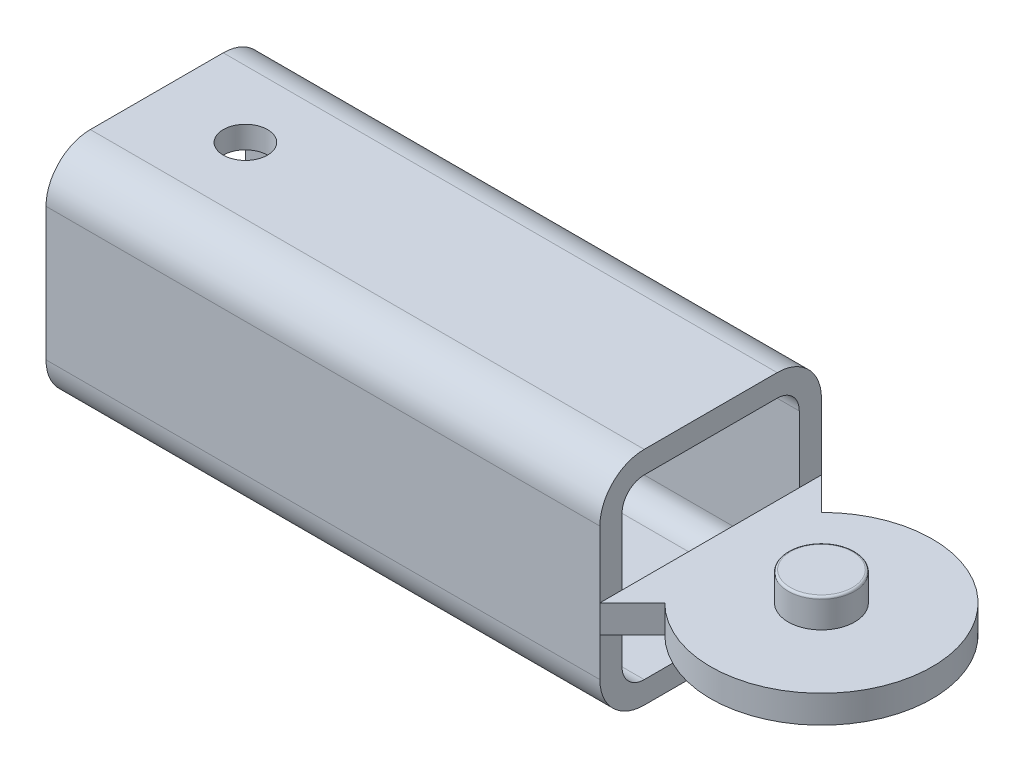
ISO-10303-21;
HEADER;
FILE_DESCRIPTION(('STEP AP214'),'2;1');
FILE_NAME('part.step','',(''),(''),'','','');
FILE_SCHEMA(('AUTOMOTIVE_DESIGN { 1 0 10303 214 1 1 1 1 }'));
ENDSEC;
DATA;
#1=APPLICATION_CONTEXT('core data for automotive mechanical design processes');
#2=APPLICATION_PROTOCOL_DEFINITION('international standard','automotive_design',2000,#1);
#3=PRODUCT_CONTEXT('',#1,'mechanical');
#4=PRODUCT('Part','Part','',(#3));
#5=PRODUCT_RELATED_PRODUCT_CATEGORY('part','',(#4));
#6=PRODUCT_DEFINITION_FORMATION('','',#4);
#7=PRODUCT_DEFINITION_CONTEXT('part definition',#1,'design');
#8=PRODUCT_DEFINITION('design','',#6,#7);
#9=PRODUCT_DEFINITION_SHAPE('','',#8);
#10=(LENGTH_UNIT() NAMED_UNIT(*) SI_UNIT(.MILLI.,.METRE.));
#11=(NAMED_UNIT(*) PLANE_ANGLE_UNIT() SI_UNIT($,.RADIAN.));
#12=(NAMED_UNIT(*) SI_UNIT($,.STERADIAN.) SOLID_ANGLE_UNIT());
#13=UNCERTAINTY_MEASURE_WITH_UNIT(LENGTH_MEASURE(1.E-05),#10,'distance_accuracy_value','');
#14=(GEOMETRIC_REPRESENTATION_CONTEXT(3) GLOBAL_UNCERTAINTY_ASSIGNED_CONTEXT((#13)) GLOBAL_UNIT_ASSIGNED_CONTEXT((#10,
#11,#12)) REPRESENTATION_CONTEXT('',''));
#15=CARTESIAN_POINT('',(0.,0.,0.));
#16=DIRECTION('',(0.,0.,1.));
#17=DIRECTION('',(1.,0.,0.));
#18=AXIS2_PLACEMENT_3D('',#15,#16,#17);
#19=CARTESIAN_POINT('',(32.6756198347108,2.6,0.));
#20=DIRECTION('',(0.,-1.,0.));
#21=DIRECTION('',(0.,0.,-1.));
#22=AXIS2_PLACEMENT_3D('',#19,#20,#21);
#23=CYLINDRICAL_SURFACE('',#22,3.);
#24=CARTESIAN_POINT('',(32.6756198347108,2.4,0.));
#25=DIRECTION('',(0.,1.,0.));
#26=DIRECTION('',(0.,0.,1.));
#27=AXIS2_PLACEMENT_3D('',#24,#25,#26);
#28=CIRCLE('',#27,3.);
#29=CARTESIAN_POINT('',(32.6756198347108,2.4,3.));
#30=VERTEX_POINT('',#29);
#31=EDGE_CURVE('E12',#30,#30,#28,.F.);
#32=ORIENTED_EDGE('',*,*,#31,.T.);
#33=EDGE_LOOP('',(#32));
#34=FACE_BOUND('',#33,.T.);
#35=CARTESIAN_POINT('',(32.6756198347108,0.,0.));
#36=DIRECTION('',(0.,1.,0.));
#37=DIRECTION('',(0.,0.,1.));
#38=AXIS2_PLACEMENT_3D('',#35,#36,#37);
#39=CIRCLE('',#38,3.);
#40=CARTESIAN_POINT('',(32.6756198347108,0.,3.));
#41=VERTEX_POINT('',#40);
#42=EDGE_CURVE('E92',#41,#41,#39,.T.);
#43=ORIENTED_EDGE('',*,*,#42,.T.);
#44=EDGE_LOOP('',(#43));
#45=FACE_BOUND('',#44,.T.);
#46=ADVANCED_FACE('F81',(#34,#45),#23,.T.);
#47=CARTESIAN_POINT('',(32.6756198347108,2.6,0.));
#48=DIRECTION('',(0.,1.,0.));
#49=DIRECTION('',(0.,0.,1.));
#50=AXIS2_PLACEMENT_3D('',#47,#48,#49);
#51=PLANE('',#50);
#52=CARTESIAN_POINT('',(32.6756198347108,2.6,0.));
#53=DIRECTION('',(0.,1.,0.));
#54=DIRECTION('',(0.,0.,1.));
#55=AXIS2_PLACEMENT_3D('',#52,#53,#54);
#56=CIRCLE('',#55,2.8);
#57=CARTESIAN_POINT('',(32.6756198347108,2.6,2.8));
#58=VERTEX_POINT('',#57);
#59=EDGE_CURVE('E88',#58,#58,#56,.T.);
#60=ORIENTED_EDGE('',*,*,#59,.T.);
#61=EDGE_LOOP('',(#60));
#62=FACE_BOUND('',#61,.T.);
#63=ADVANCED_FACE('F102',(#62),#51,.T.);
#64=CARTESIAN_POINT('',(32.6756198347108,0.,0.));
#65=DIRECTION('',(0.,1.,0.));
#66=DIRECTION('',(0.,0.,1.));
#67=AXIS2_PLACEMENT_3D('',#64,#65,#66);
#68=PLANE('',#67);
#69=ORIENTED_EDGE('',*,*,#42,.F.);
#70=EDGE_LOOP('',(#69));
#71=FACE_BOUND('',#70,.T.);
#72=ADVANCED_FACE('F100',(#71),#68,.F.);
#73=CARTESIAN_POINT('',(32.6756198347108,2.4,0.));
#74=DIRECTION('',(0.,1.,0.));
#75=DIRECTION('',(0.,0.,1.));
#76=AXIS2_PLACEMENT_3D('',#73,#74,#75);
#77=TOROIDAL_SURFACE('',#76,2.8,0.2);
#78=ORIENTED_EDGE('',*,*,#31,.F.);
#79=EDGE_LOOP('',(#78));
#80=FACE_BOUND('',#79,.T.);
#81=ORIENTED_EDGE('',*,*,#59,.F.);
#82=EDGE_LOOP('',(#81));
#83=FACE_BOUND('',#82,.T.);
#84=ADVANCED_FACE('F83',(#80,#83),#77,.T.);
#85=CLOSED_SHELL('',(#46,#63,#72,#84));
#86=MANIFOLD_SOLID_BREP('B2',#85);
#87=CARTESIAN_POINT('',(22.6756198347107,-6.,10.));
#88=DIRECTION('',(0.,0.,-1.));
#89=DIRECTION('',(-1.,0.,0.));
#90=AXIS2_PLACEMENT_3D('',#87,#88,#89);
#91=PLANE('',#90);
#92=DIRECTION('',(0.,-1.,0.));
#93=VECTOR('',#92,1.);
#94=CARTESIAN_POINT('',(22.6756198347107,-6.,10.));
#95=LINE('',#94,#93);
#96=CARTESIAN_POINT('',(22.6756198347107,-2.5,10.));
#97=VERTEX_POINT('',#96);
#98=CARTESIAN_POINT('',(22.6756198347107,-6.,10.));
#99=VERTEX_POINT('',#98);
#100=EDGE_CURVE('E396',#97,#99,#95,.T.);
#101=ORIENTED_EDGE('',*,*,#100,.F.);
#102=DIRECTION('',(0.,1.,0.));
#103=VECTOR('',#102,1.);
#104=CARTESIAN_POINT('',(22.6756198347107,-20.,10.));
#105=LINE('',#104,#103);
#106=CARTESIAN_POINT('',(22.6756198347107,0.,10.));
#107=VERTEX_POINT('',#106);
#108=EDGE_CURVE('E314',#97,#107,#105,.T.);
#109=ORIENTED_EDGE('',*,*,#108,.T.);
#110=CARTESIAN_POINT('',(22.6756198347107,6.,10.));
#111=VERTEX_POINT('',#110);
#112=EDGE_CURVE('E397',#111,#107,#95,.T.);
#113=ORIENTED_EDGE('',*,*,#112,.F.);
#114=DIRECTION('',(-1.,0.,0.));
#115=VECTOR('',#114,1.);
#116=CARTESIAN_POINT('',(22.6756198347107,6.,10.));
#117=LINE('',#116,#115);
#118=CARTESIAN_POINT('',(-27.3243801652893,6.,10.));
#119=VERTEX_POINT('',#118);
#120=EDGE_CURVE('E491',#111,#119,#117,.T.);
#121=ORIENTED_EDGE('',*,*,#120,.T.);
#122=DIRECTION('',(0.,-1.,0.));
#123=VECTOR('',#122,1.);
#124=CARTESIAN_POINT('',(-27.3243801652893,-6.,10.));
#125=LINE('',#124,#123);
#126=CARTESIAN_POINT('',(-27.3243801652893,-6.,10.));
#127=VERTEX_POINT('',#126);
#128=EDGE_CURVE('E456',#119,#127,#125,.T.);
#129=ORIENTED_EDGE('',*,*,#128,.T.);
#130=DIRECTION('',(-1.,0.,0.));
#131=VECTOR('',#130,1.);
#132=CARTESIAN_POINT('',(22.6756198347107,-6.,10.));
#133=LINE('',#132,#131);
#134=EDGE_CURVE('E487',#99,#127,#133,.T.);
#135=ORIENTED_EDGE('',*,*,#134,.F.);
#136=EDGE_LOOP('',(#101,#109,#113,#121,#129,#135));
#137=FACE_BOUND('',#136,.T.);
#138=ADVANCED_FACE('F137',(#137),#91,.F.);
#139=CARTESIAN_POINT('',(42.6756198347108,0.,10.));
#140=DIRECTION('',(0.,-1.,0.));
#141=DIRECTION('',(0.,0.,-1.));
#142=AXIS2_PLACEMENT_3D('',#139,#140,#141);
#143=PLANE('',#142);
#144=DIRECTION('',(-0.707106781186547,0.,0.707106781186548));
#145=VECTOR('',#144,1.);
#146=CARTESIAN_POINT('',(25.6045520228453,0.,7.07106781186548));
#147=LINE('',#146,#145);
#148=CARTESIAN_POINT('',(25.6045520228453,0.,7.07106781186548));
#149=VERTEX_POINT('',#148);
#150=EDGE_CURVE('E310',#149,#107,#147,.T.);
#151=ORIENTED_EDGE('',*,*,#150,.F.);
#152=CARTESIAN_POINT('',(32.6756198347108,0.,0.));
#153=DIRECTION('',(0.,-1.,0.));
#154=DIRECTION('',(0.,0.,-1.));
#155=AXIS2_PLACEMENT_3D('',#152,#153,#154);
#156=CIRCLE('',#155,10.);
#157=CARTESIAN_POINT('',(25.6045520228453,0.,-7.07106781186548));
#158=VERTEX_POINT('',#157);
#159=EDGE_CURVE('E293',#158,#149,#156,.T.);
#160=ORIENTED_EDGE('',*,*,#159,.F.);
#161=DIRECTION('',(0.707106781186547,0.,0.707106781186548));
#162=VECTOR('',#161,1.);
#163=CARTESIAN_POINT('',(25.6045520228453,0.,-7.07106781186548));
#164=LINE('',#163,#162);
#165=CARTESIAN_POINT('',(22.6756198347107,0.,-10.));
#166=VERTEX_POINT('',#165);
#167=EDGE_CURVE('E319',#166,#158,#164,.T.);
#168=ORIENTED_EDGE('',*,*,#167,.F.);
#169=DIRECTION('',(0.,0.,1.));
#170=VECTOR('',#169,1.);
#171=CARTESIAN_POINT('',(22.6756198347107,0.,10.));
#172=LINE('',#171,#170);
#173=CARTESIAN_POINT('',(22.6756198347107,0.,-8.));
#174=VERTEX_POINT('',#173);
#175=EDGE_CURVE('E344',#166,#174,#172,.T.);
#176=ORIENTED_EDGE('',*,*,#175,.T.);
#177=CARTESIAN_POINT('',(22.6756198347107,0.,8.));
#178=VERTEX_POINT('',#177);
#179=EDGE_CURVE('E343',#174,#178,#172,.T.);
#180=ORIENTED_EDGE('',*,*,#179,.T.);
#181=EDGE_CURVE('E147',#178,#107,#172,.T.);
#182=ORIENTED_EDGE('',*,*,#181,.T.);
#183=EDGE_LOOP('',(#151,#160,#168,#176,#180,#182));
#184=FACE_BOUND('',#183,.T.);
#185=ADVANCED_FACE('F316',(#184),#143,.F.);
#186=CARTESIAN_POINT('',(42.6756198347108,-2.5,10.));
#187=DIRECTION('',(0.,1.,0.));
#188=DIRECTION('',(0.,0.,1.));
#189=AXIS2_PLACEMENT_3D('',#186,#187,#188);
#190=PLANE('',#189);
#191=CARTESIAN_POINT('',(32.6756198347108,-2.5,0.));
#192=DIRECTION('',(0.,-1.,0.));
#193=DIRECTION('',(0.,0.,-1.));
#194=AXIS2_PLACEMENT_3D('',#191,#192,#193);
#195=CIRCLE('',#194,8.);
#196=CARTESIAN_POINT('',(32.6756198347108,-2.5,-8.));
#197=VERTEX_POINT('',#196);
#198=EDGE_CURVE('E326',#197,#197,#195,.T.);
#199=ORIENTED_EDGE('',*,*,#198,.F.);
#200=EDGE_LOOP('',(#199));
#201=FACE_BOUND('',#200,.T.);
#202=CARTESIAN_POINT('',(32.6756198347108,-2.5,0.));
#203=DIRECTION('',(0.,1.,0.));
#204=DIRECTION('',(0.,0.,1.));
#205=AXIS2_PLACEMENT_3D('',#202,#203,#204);
#206=CIRCLE('',#205,10.);
#207=CARTESIAN_POINT('',(25.6045520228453,-2.5,-7.07106781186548));
#208=VERTEX_POINT('',#207);
#209=CARTESIAN_POINT('',(25.6045520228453,-2.5,7.07106781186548));
#210=VERTEX_POINT('',#209);
#211=EDGE_CURVE('E304',#208,#210,#206,.F.);
#212=ORIENTED_EDGE('',*,*,#211,.T.);
#213=DIRECTION('',(-0.707106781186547,0.,0.707106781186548));
#214=VECTOR('',#213,1.);
#215=CARTESIAN_POINT('',(32.6756198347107,-2.5,0.));
#216=LINE('',#215,#214);
#217=EDGE_CURVE('E305',#210,#97,#216,.T.);
#218=ORIENTED_EDGE('',*,*,#217,.T.);
#219=DIRECTION('',(0.,0.,-1.));
#220=VECTOR('',#219,1.);
#221=CARTESIAN_POINT('',(22.6756198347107,-2.5,10.));
#222=LINE('',#221,#220);
#223=CARTESIAN_POINT('',(22.6756198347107,-2.5,8.));
#224=VERTEX_POINT('',#223);
#225=EDGE_CURVE('E149',#97,#224,#222,.T.);
#226=ORIENTED_EDGE('',*,*,#225,.T.);
#227=CARTESIAN_POINT('',(22.6756198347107,-2.5,-8.));
#228=VERTEX_POINT('',#227);
#229=EDGE_CURVE('E150',#224,#228,#222,.T.);
#230=ORIENTED_EDGE('',*,*,#229,.T.);
#231=CARTESIAN_POINT('',(22.6756198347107,-2.5,-10.));
#232=VERTEX_POINT('',#231);
#233=EDGE_CURVE('E79',#228,#232,#222,.T.);
#234=ORIENTED_EDGE('',*,*,#233,.T.);
#235=DIRECTION('',(0.707106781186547,0.,0.707106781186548));
#236=VECTOR('',#235,1.);
#237=CARTESIAN_POINT('',(42.6756198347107,-2.5,10.));
#238=LINE('',#237,#236);
#239=EDGE_CURVE('E329',#232,#208,#238,.T.);
#240=ORIENTED_EDGE('',*,*,#239,.T.);
#241=EDGE_LOOP('',(#212,#218,#226,#230,#234,#240));
#242=FACE_BOUND('',#241,.T.);
#243=ADVANCED_FACE('F586',(#201,#242),#190,.F.);
#244=CARTESIAN_POINT('',(22.6756198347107,6.,-6.));
#245=DIRECTION('',(1.,0.,0.));
#246=DIRECTION('',(0.,0.,-1.));
#247=AXIS2_PLACEMENT_3D('',#244,#245,#246);
#248=PLANE('',#247);
#249=ORIENTED_EDGE('',*,*,#225,.F.);
#250=ORIENTED_EDGE('',*,*,#100,.T.);
#251=CARTESIAN_POINT('',(22.6756198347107,-6.,6.));
#252=DIRECTION('',(1.,0.,0.));
#253=DIRECTION('',(0.,0.,-1.));
#254=AXIS2_PLACEMENT_3D('',#251,#252,#253);
#255=CIRCLE('',#254,4.);
#256=CARTESIAN_POINT('',(22.6756198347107,-10.,6.));
#257=VERTEX_POINT('',#256);
#258=EDGE_CURVE('E400',#99,#257,#255,.T.);
#259=ORIENTED_EDGE('',*,*,#258,.T.);
#260=DIRECTION('',(0.,0.,-1.));
#261=VECTOR('',#260,1.);
#262=CARTESIAN_POINT('',(22.6756198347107,-10.,6.));
#263=LINE('',#262,#261);
#264=CARTESIAN_POINT('',(22.6756198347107,-10.,-6.));
#265=VERTEX_POINT('',#264);
#266=EDGE_CURVE('E403',#257,#265,#263,.T.);
#267=ORIENTED_EDGE('',*,*,#266,.T.);
#268=CARTESIAN_POINT('',(22.6756198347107,-6.,-6.));
#269=DIRECTION('',(1.,0.,0.));
#270=DIRECTION('',(0.,0.,-1.));
#271=AXIS2_PLACEMENT_3D('',#268,#269,#270);
#272=CIRCLE('',#271,4.);
#273=CARTESIAN_POINT('',(22.6756198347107,-6.,-10.));
#274=VERTEX_POINT('',#273);
#275=EDGE_CURVE('E406',#265,#274,#272,.T.);
#276=ORIENTED_EDGE('',*,*,#275,.T.);
#277=DIRECTION('',(0.,1.,0.));
#278=VECTOR('',#277,1.);
#279=CARTESIAN_POINT('',(22.6756198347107,6.,-10.));
#280=LINE('',#279,#278);
#281=EDGE_CURVE('E410',#274,#232,#280,.T.);
#282=ORIENTED_EDGE('',*,*,#281,.T.);
#283=ORIENTED_EDGE('',*,*,#233,.F.);
#284=DIRECTION('',(0.,1.,0.));
#285=VECTOR('',#284,1.);
#286=CARTESIAN_POINT('',(22.6756198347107,6.,-8.));
#287=LINE('',#286,#285);
#288=CARTESIAN_POINT('',(22.6756198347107,-6.,-8.));
#289=VERTEX_POINT('',#288);
#290=EDGE_CURVE('E365',#289,#228,#287,.T.);
#291=ORIENTED_EDGE('',*,*,#290,.F.);
#292=CARTESIAN_POINT('',(22.6756198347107,-6.,-6.));
#293=DIRECTION('',(1.,0.,0.));
#294=DIRECTION('',(0.,0.,-1.));
#295=AXIS2_PLACEMENT_3D('',#292,#293,#294);
#296=CIRCLE('',#295,2.);
#297=CARTESIAN_POINT('',(22.6756198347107,-8.,-6.));
#298=VERTEX_POINT('',#297);
#299=EDGE_CURVE('E369',#298,#289,#296,.T.);
#300=ORIENTED_EDGE('',*,*,#299,.F.);
#301=DIRECTION('',(0.,0.,-1.));
#302=VECTOR('',#301,1.);
#303=CARTESIAN_POINT('',(22.6756198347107,-8.,6.));
#304=LINE('',#303,#302);
#305=CARTESIAN_POINT('',(22.6756198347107,-8.,6.));
#306=VERTEX_POINT('',#305);
#307=EDGE_CURVE('E374',#306,#298,#304,.T.);
#308=ORIENTED_EDGE('',*,*,#307,.F.);
#309=CARTESIAN_POINT('',(22.6756198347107,-6.,6.));
#310=DIRECTION('',(1.,0.,0.));
#311=DIRECTION('',(0.,0.,-1.));
#312=AXIS2_PLACEMENT_3D('',#309,#310,#311);
#313=CIRCLE('',#312,2.);
#314=CARTESIAN_POINT('',(22.6756198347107,-6.,8.));
#315=VERTEX_POINT('',#314);
#316=EDGE_CURVE('E378',#315,#306,#313,.T.);
#317=ORIENTED_EDGE('',*,*,#316,.F.);
#318=DIRECTION('',(0.,-1.,0.));
#319=VECTOR('',#318,1.);
#320=CARTESIAN_POINT('',(22.6756198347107,-6.,8.));
#321=LINE('',#320,#319);
#322=EDGE_CURVE('E157',#224,#315,#321,.T.);
#323=ORIENTED_EDGE('',*,*,#322,.F.);
#324=EDGE_LOOP('',(#249,#250,#259,#267,#276,#282,#283,#291,#300,#308,#317,#323));
#325=FACE_BOUND('',#324,.T.);
#326=ADVANCED_FACE('F587',(#325),#248,.T.);
#327=CARTESIAN_POINT('',(22.6756198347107,6.,-6.));
#328=DIRECTION('',(-1.,0.,0.));
#329=DIRECTION('',(0.,0.,1.));
#330=AXIS2_PLACEMENT_3D('',#327,#328,#329);
#331=CYLINDRICAL_SURFACE('',#330,4.);
#332=CARTESIAN_POINT('',(-27.3243801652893,6.,-6.));
#333=DIRECTION('',(1.,0.,0.));
#334=DIRECTION('',(0.,0.,-1.));
#335=AXIS2_PLACEMENT_3D('',#332,#333,#334);
#336=CIRCLE('',#335,4.);
#337=CARTESIAN_POINT('',(-27.3243801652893,6.,-10.));
#338=VERTEX_POINT('',#337);
#339=CARTESIAN_POINT('',(-27.3243801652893,10.,-6.));
#340=VERTEX_POINT('',#339);
#341=EDGE_CURVE('E446',#338,#340,#336,.T.);
#342=ORIENTED_EDGE('',*,*,#341,.T.);
#343=DIRECTION('',(-1.,0.,0.));
#344=VECTOR('',#343,1.);
#345=CARTESIAN_POINT('',(22.6756198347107,10.,-6.));
#346=LINE('',#345,#344);
#347=CARTESIAN_POINT('',(22.6756198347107,10.,-6.));
#348=VERTEX_POINT('',#347);
#349=EDGE_CURVE('E499',#348,#340,#346,.T.);
#350=ORIENTED_EDGE('',*,*,#349,.F.);
#351=CARTESIAN_POINT('',(22.6756198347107,6.,-6.));
#352=DIRECTION('',(1.,0.,0.));
#353=DIRECTION('',(0.,0.,-1.));
#354=AXIS2_PLACEMENT_3D('',#351,#352,#353);
#355=CIRCLE('',#354,4.);
#356=CARTESIAN_POINT('',(22.6756198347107,6.,-10.));
#357=VERTEX_POINT('',#356);
#358=EDGE_CURVE('E385',#357,#348,#355,.T.);
#359=ORIENTED_EDGE('',*,*,#358,.F.);
#360=DIRECTION('',(-1.,0.,0.));
#361=VECTOR('',#360,1.);
#362=CARTESIAN_POINT('',(22.6756198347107,6.,-10.));
#363=LINE('',#362,#361);
#364=EDGE_CURVE('E470',#357,#338,#363,.T.);
#365=ORIENTED_EDGE('',*,*,#364,.T.);
#366=EDGE_LOOP('',(#342,#350,#359,#365));
#367=FACE_BOUND('',#366,.T.);
#368=ADVANCED_FACE('F571',(#367),#331,.T.);
#369=CARTESIAN_POINT('',(22.6756198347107,10.,-6.));
#370=DIRECTION('',(0.,-1.,0.));
#371=DIRECTION('',(0.,0.,-1.));
#372=AXIS2_PLACEMENT_3D('',#369,#370,#371);
#373=PLANE('',#372);
#374=CARTESIAN_POINT('',(-19.3243801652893,10.,0.));
#375=DIRECTION('',(0.,-1.,0.));
#376=DIRECTION('',(0.,0.,-1.));
#377=AXIS2_PLACEMENT_3D('',#374,#375,#376);
#378=CIRCLE('',#377,2.);
#379=CARTESIAN_POINT('',(-19.3243801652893,10.,-2.));
#380=VERTEX_POINT('',#379);
#381=EDGE_CURVE('E680',#380,#380,#378,.T.);
#382=ORIENTED_EDGE('',*,*,#381,.T.);
#383=EDGE_LOOP('',(#382));
#384=FACE_BOUND('',#383,.T.);
#385=DIRECTION('',(0.,0.,1.));
#386=VECTOR('',#385,1.);
#387=CARTESIAN_POINT('',(-27.3243801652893,10.,-6.));
#388=LINE('',#387,#386);
#389=CARTESIAN_POINT('',(-27.3243801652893,10.,6.));
#390=VERTEX_POINT('',#389);
#391=EDGE_CURVE('E450',#340,#390,#388,.T.);
#392=ORIENTED_EDGE('',*,*,#391,.T.);
#393=DIRECTION('',(-1.,0.,0.));
#394=VECTOR('',#393,1.);
#395=CARTESIAN_POINT('',(22.6756198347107,10.,6.));
#396=LINE('',#395,#394);
#397=CARTESIAN_POINT('',(22.6756198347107,10.,6.));
#398=VERTEX_POINT('',#397);
#399=EDGE_CURVE('E495',#398,#390,#396,.T.);
#400=ORIENTED_EDGE('',*,*,#399,.F.);
#401=DIRECTION('',(0.,0.,1.));
#402=VECTOR('',#401,1.);
#403=CARTESIAN_POINT('',(22.6756198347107,10.,-6.));
#404=LINE('',#403,#402);
#405=EDGE_CURVE('E390',#348,#398,#404,.T.);
#406=ORIENTED_EDGE('',*,*,#405,.F.);
#407=ORIENTED_EDGE('',*,*,#349,.T.);
#408=EDGE_LOOP('',(#392,#400,#406,#407));
#409=FACE_BOUND('',#408,.T.);
#410=ADVANCED_FACE('F573',(#384,#409),#373,.F.);
#411=CARTESIAN_POINT('',(22.6756198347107,6.,6.));
#412=DIRECTION('',(-1.,0.,0.));
#413=DIRECTION('',(0.,0.,1.));
#414=AXIS2_PLACEMENT_3D('',#411,#412,#413);
#415=CYLINDRICAL_SURFACE('',#414,4.);
#416=CARTESIAN_POINT('',(-27.3243801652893,6.,6.));
#417=DIRECTION('',(1.,0.,0.));
#418=DIRECTION('',(0.,0.,-1.));
#419=AXIS2_PLACEMENT_3D('',#416,#417,#418);
#420=CIRCLE('',#419,4.);
#421=EDGE_CURVE('E453',#390,#119,#420,.T.);
#422=ORIENTED_EDGE('',*,*,#421,.T.);
#423=ORIENTED_EDGE('',*,*,#120,.F.);
#424=CARTESIAN_POINT('',(22.6756198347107,6.,6.));
#425=DIRECTION('',(1.,0.,0.));
#426=DIRECTION('',(0.,0.,-1.));
#427=AXIS2_PLACEMENT_3D('',#424,#425,#426);
#428=CIRCLE('',#427,4.);
#429=EDGE_CURVE('E393',#398,#111,#428,.T.);
#430=ORIENTED_EDGE('',*,*,#429,.F.);
#431=ORIENTED_EDGE('',*,*,#399,.T.);
#432=EDGE_LOOP('',(#422,#423,#430,#431));
#433=FACE_BOUND('',#432,.T.);
#434=ADVANCED_FACE('F579',(#433),#415,.T.);
#435=CARTESIAN_POINT('',(22.6756198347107,-6.,6.));
#436=DIRECTION('',(-1.,0.,0.));
#437=DIRECTION('',(0.,0.,1.));
#438=AXIS2_PLACEMENT_3D('',#435,#436,#437);
#439=CYLINDRICAL_SURFACE('',#438,4.);
#440=CARTESIAN_POINT('',(-27.3243801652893,-6.,6.));
#441=DIRECTION('',(1.,0.,0.));
#442=DIRECTION('',(0.,0.,-1.));
#443=AXIS2_PLACEMENT_3D('',#440,#441,#442);
#444=CIRCLE('',#443,4.);
#445=CARTESIAN_POINT('',(-27.3243801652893,-10.,6.));
#446=VERTEX_POINT('',#445);
#447=EDGE_CURVE('E459',#127,#446,#444,.T.);
#448=ORIENTED_EDGE('',*,*,#447,.T.);
#449=DIRECTION('',(-1.,0.,0.));
#450=VECTOR('',#449,1.);
#451=CARTESIAN_POINT('',(22.6756198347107,-10.,6.));
#452=LINE('',#451,#450);
#453=EDGE_CURVE('E483',#257,#446,#452,.T.);
#454=ORIENTED_EDGE('',*,*,#453,.F.);
#455=ORIENTED_EDGE('',*,*,#258,.F.);
#456=ORIENTED_EDGE('',*,*,#134,.T.);
#457=EDGE_LOOP('',(#448,#454,#455,#456));
#458=FACE_BOUND('',#457,.T.);
#459=ADVANCED_FACE('F592',(#458),#439,.T.);
#460=CARTESIAN_POINT('',(22.6756198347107,-10.,6.));
#461=DIRECTION('',(0.,1.,0.));
#462=DIRECTION('',(0.,0.,1.));
#463=AXIS2_PLACEMENT_3D('',#460,#461,#462);
#464=PLANE('',#463);
#465=CARTESIAN_POINT('',(-19.3243801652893,-10.,0.));
#466=DIRECTION('',(0.,-1.,0.));
#467=DIRECTION('',(0.,0.,-1.));
#468=AXIS2_PLACEMENT_3D('',#465,#466,#467);
#469=CIRCLE('',#468,2.);
#470=CARTESIAN_POINT('',(-19.3243801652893,-10.,-2.));
#471=VERTEX_POINT('',#470);
#472=EDGE_CURVE('E677',#471,#471,#469,.T.);
#473=ORIENTED_EDGE('',*,*,#472,.F.);
#474=EDGE_LOOP('',(#473));
#475=FACE_BOUND('',#474,.T.);
#476=DIRECTION('',(0.,0.,-1.));
#477=VECTOR('',#476,1.);
#478=CARTESIAN_POINT('',(-27.3243801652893,-10.,6.));
#479=LINE('',#478,#477);
#480=CARTESIAN_POINT('',(-27.3243801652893,-10.,-6.));
#481=VERTEX_POINT('',#480);
#482=EDGE_CURVE('E462',#446,#481,#479,.T.);
#483=ORIENTED_EDGE('',*,*,#482,.T.);
#484=DIRECTION('',(-1.,0.,0.));
#485=VECTOR('',#484,1.);
#486=CARTESIAN_POINT('',(22.6756198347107,-10.,-6.));
#487=LINE('',#486,#485);
#488=EDGE_CURVE('E479',#265,#481,#487,.T.);
#489=ORIENTED_EDGE('',*,*,#488,.F.);
#490=ORIENTED_EDGE('',*,*,#266,.F.);
#491=ORIENTED_EDGE('',*,*,#453,.T.);
#492=EDGE_LOOP('',(#483,#489,#490,#491));
#493=FACE_BOUND('',#492,.T.);
#494=ADVANCED_FACE('F597',(#475,#493),#464,.F.);
#495=CARTESIAN_POINT('',(22.6756198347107,-6.,-6.));
#496=DIRECTION('',(-1.,0.,0.));
#497=DIRECTION('',(0.,0.,1.));
#498=AXIS2_PLACEMENT_3D('',#495,#496,#497);
#499=CYLINDRICAL_SURFACE('',#498,4.);
#500=CARTESIAN_POINT('',(-27.3243801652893,-6.,-6.));
#501=DIRECTION('',(1.,0.,0.));
#502=DIRECTION('',(0.,0.,-1.));
#503=AXIS2_PLACEMENT_3D('',#500,#501,#502);
#504=CIRCLE('',#503,4.);
#505=CARTESIAN_POINT('',(-27.3243801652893,-6.,-10.));
#506=VERTEX_POINT('',#505);
#507=EDGE_CURVE('E465',#481,#506,#504,.T.);
#508=ORIENTED_EDGE('',*,*,#507,.T.);
#509=DIRECTION('',(-1.,0.,0.));
#510=VECTOR('',#509,1.);
#511=CARTESIAN_POINT('',(22.6756198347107,-6.,-10.));
#512=LINE('',#511,#510);
#513=EDGE_CURVE('E474',#274,#506,#512,.T.);
#514=ORIENTED_EDGE('',*,*,#513,.F.);
#515=ORIENTED_EDGE('',*,*,#275,.F.);
#516=ORIENTED_EDGE('',*,*,#488,.T.);
#517=EDGE_LOOP('',(#508,#514,#515,#516));
#518=FACE_BOUND('',#517,.T.);
#519=ADVANCED_FACE('F602',(#518),#499,.T.);
#520=CARTESIAN_POINT('',(22.6756198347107,6.,6.));
#521=DIRECTION('',(-1.,0.,0.));
#522=DIRECTION('',(0.,0.,1.));
#523=AXIS2_PLACEMENT_3D('',#520,#521,#522);
#524=CYLINDRICAL_SURFACE('',#523,2.);
#525=CARTESIAN_POINT('',(-27.3243801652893,6.,6.));
#526=DIRECTION('',(1.,0.,0.));
#527=DIRECTION('',(0.,0.,-1.));
#528=AXIS2_PLACEMENT_3D('',#525,#526,#527);
#529=CIRCLE('',#528,2.);
#530=CARTESIAN_POINT('',(-27.3243801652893,8.,6.));
#531=VERTEX_POINT('',#530);
#532=CARTESIAN_POINT('',(-27.3243801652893,6.,8.));
#533=VERTEX_POINT('',#532);
#534=EDGE_CURVE('E350',#531,#533,#529,.T.);
#535=ORIENTED_EDGE('',*,*,#534,.F.);
#536=DIRECTION('',(-1.,0.,0.));
#537=VECTOR('',#536,1.);
#538=CARTESIAN_POINT('',(22.6756198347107,8.,6.));
#539=LINE('',#538,#537);
#540=CARTESIAN_POINT('',(22.6756198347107,8.,6.));
#541=VERTEX_POINT('',#540);
#542=EDGE_CURVE('E475',#541,#531,#539,.T.);
#543=ORIENTED_EDGE('',*,*,#542,.F.);
#544=CARTESIAN_POINT('',(22.6756198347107,6.,6.));
#545=DIRECTION('',(1.,0.,0.));
#546=DIRECTION('',(0.,0.,-1.));
#547=AXIS2_PLACEMENT_3D('',#544,#545,#546);
#548=CIRCLE('',#547,2.);
#549=CARTESIAN_POINT('',(22.6756198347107,6.,8.));
#550=VERTEX_POINT('',#549);
#551=EDGE_CURVE('E351',#541,#550,#548,.T.);
#552=ORIENTED_EDGE('',*,*,#551,.T.);
#553=DIRECTION('',(-1.,0.,0.));
#554=VECTOR('',#553,1.);
#555=CARTESIAN_POINT('',(22.6756198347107,6.,8.));
#556=LINE('',#555,#554);
#557=EDGE_CURVE('E414',#550,#533,#556,.T.);
#558=ORIENTED_EDGE('',*,*,#557,.T.);
#559=EDGE_LOOP('',(#535,#543,#552,#558));
#560=FACE_BOUND('',#559,.T.);
#561=ADVANCED_FACE('F139',(#560),#524,.F.);
#562=CARTESIAN_POINT('',(22.6756198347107,8.,-6.));
#563=DIRECTION('',(0.,-1.,0.));
#564=DIRECTION('',(0.,0.,-1.));
#565=AXIS2_PLACEMENT_3D('',#562,#563,#564);
#566=PLANE('',#565);
#567=CARTESIAN_POINT('',(-19.3243801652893,8.,0.));
#568=DIRECTION('',(0.,-1.,0.));
#569=DIRECTION('',(0.,0.,-1.));
#570=AXIS2_PLACEMENT_3D('',#567,#568,#569);
#571=CIRCLE('',#570,2.);
#572=CARTESIAN_POINT('',(-19.3243801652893,8.,-2.));
#573=VERTEX_POINT('',#572);
#574=EDGE_CURVE('E686',#573,#573,#571,.T.);
#575=ORIENTED_EDGE('',*,*,#574,.F.);
#576=EDGE_LOOP('',(#575));
#577=FACE_BOUND('',#576,.T.);
#578=DIRECTION('',(0.,0.,1.));
#579=VECTOR('',#578,1.);
#580=CARTESIAN_POINT('',(-27.3243801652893,8.,-6.));
#581=LINE('',#580,#579);
#582=CARTESIAN_POINT('',(-27.3243801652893,8.,-6.));
#583=VERTEX_POINT('',#582);
#584=EDGE_CURVE('E418',#583,#531,#581,.T.);
#585=ORIENTED_EDGE('',*,*,#584,.F.);
#586=DIRECTION('',(-1.,0.,0.));
#587=VECTOR('',#586,1.);
#588=CARTESIAN_POINT('',(22.6756198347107,8.,-6.));
#589=LINE('',#588,#587);
#590=CARTESIAN_POINT('',(22.6756198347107,8.,-6.));
#591=VERTEX_POINT('',#590);
#592=EDGE_CURVE('E520',#591,#583,#589,.T.);
#593=ORIENTED_EDGE('',*,*,#592,.F.);
#594=DIRECTION('',(0.,0.,1.));
#595=VECTOR('',#594,1.);
#596=CARTESIAN_POINT('',(22.6756198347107,8.,-6.));
#597=LINE('',#596,#595);
#598=EDGE_CURVE('E355',#591,#541,#597,.T.);
#599=ORIENTED_EDGE('',*,*,#598,.T.);
#600=ORIENTED_EDGE('',*,*,#542,.T.);
#601=EDGE_LOOP('',(#585,#593,#599,#600));
#602=FACE_BOUND('',#601,.T.);
#603=ADVANCED_FACE('F526',(#577,#602),#566,.T.);
#604=CARTESIAN_POINT('',(22.6756198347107,6.,-6.));
#605=DIRECTION('',(-1.,0.,0.));
#606=DIRECTION('',(0.,0.,1.));
#607=AXIS2_PLACEMENT_3D('',#604,#605,#606);
#608=CYLINDRICAL_SURFACE('',#607,2.);
#609=CARTESIAN_POINT('',(-27.3243801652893,6.,-6.));
#610=DIRECTION('',(1.,0.,0.));
#611=DIRECTION('',(0.,0.,-1.));
#612=AXIS2_PLACEMENT_3D('',#609,#610,#611);
#613=CIRCLE('',#612,2.);
#614=CARTESIAN_POINT('',(-27.3243801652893,6.,-8.));
#615=VERTEX_POINT('',#614);
#616=EDGE_CURVE('E422',#615,#583,#613,.T.);
#617=ORIENTED_EDGE('',*,*,#616,.F.);
#618=DIRECTION('',(-1.,0.,0.));
#619=VECTOR('',#618,1.);
#620=CARTESIAN_POINT('',(22.6756198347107,6.,-8.));
#621=LINE('',#620,#619);
#622=CARTESIAN_POINT('',(22.6756198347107,6.,-8.));
#623=VERTEX_POINT('',#622);
#624=EDGE_CURVE('E517',#623,#615,#621,.T.);
#625=ORIENTED_EDGE('',*,*,#624,.F.);
#626=CARTESIAN_POINT('',(22.6756198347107,6.,-6.));
#627=DIRECTION('',(1.,0.,0.));
#628=DIRECTION('',(0.,0.,-1.));
#629=AXIS2_PLACEMENT_3D('',#626,#627,#628);
#630=CIRCLE('',#629,2.);
#631=EDGE_CURVE('E360',#623,#591,#630,.T.);
#632=ORIENTED_EDGE('',*,*,#631,.T.);
#633=ORIENTED_EDGE('',*,*,#592,.T.);
#634=EDGE_LOOP('',(#617,#625,#632,#633));
#635=FACE_BOUND('',#634,.T.);
#636=ADVANCED_FACE('F538',(#635),#608,.F.);
#637=CARTESIAN_POINT('',(22.6756198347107,6.,-8.));
#638=DIRECTION('',(0.,0.,1.));
#639=DIRECTION('',(1.,0.,0.));
#640=AXIS2_PLACEMENT_3D('',#637,#638,#639);
#641=PLANE('',#640);
#642=DIRECTION('',(0.,1.,0.));
#643=VECTOR('',#642,1.);
#644=CARTESIAN_POINT('',(-27.3243801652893,6.,-8.));
#645=LINE('',#644,#643);
#646=CARTESIAN_POINT('',(-27.3243801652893,-6.,-8.));
#647=VERTEX_POINT('',#646);
#648=EDGE_CURVE('E426',#647,#615,#645,.T.);
#649=ORIENTED_EDGE('',*,*,#648,.F.);
#650=DIRECTION('',(-1.,0.,0.));
#651=VECTOR('',#650,1.);
#652=CARTESIAN_POINT('',(22.6756198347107,-6.,-8.));
#653=LINE('',#652,#651);
#654=EDGE_CURVE('E514',#289,#647,#653,.T.);
#655=ORIENTED_EDGE('',*,*,#654,.F.);
#656=ORIENTED_EDGE('',*,*,#290,.T.);
#657=EDGE_CURVE('E370',#228,#174,#287,.T.);
#658=ORIENTED_EDGE('',*,*,#657,.T.);
#659=EDGE_CURVE('E364',#174,#623,#287,.T.);
#660=ORIENTED_EDGE('',*,*,#659,.T.);
#661=ORIENTED_EDGE('',*,*,#624,.T.);
#662=EDGE_LOOP('',(#649,#655,#656,#658,#660,#661));
#663=FACE_BOUND('',#662,.T.);
#664=ADVANCED_FACE('F609',(#663),#641,.T.);
#665=CARTESIAN_POINT('',(22.6756198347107,-6.,-6.));
#666=DIRECTION('',(-1.,0.,0.));
#667=DIRECTION('',(0.,0.,1.));
#668=AXIS2_PLACEMENT_3D('',#665,#666,#667);
#669=CYLINDRICAL_SURFACE('',#668,2.);
#670=CARTESIAN_POINT('',(-27.3243801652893,-6.,-6.));
#671=DIRECTION('',(1.,0.,0.));
#672=DIRECTION('',(0.,0.,-1.));
#673=AXIS2_PLACEMENT_3D('',#670,#671,#672);
#674=CIRCLE('',#673,2.);
#675=CARTESIAN_POINT('',(-27.3243801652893,-8.,-6.));
#676=VERTEX_POINT('',#675);
#677=EDGE_CURVE('E430',#676,#647,#674,.T.);
#678=ORIENTED_EDGE('',*,*,#677,.F.);
#679=DIRECTION('',(-1.,0.,0.));
#680=VECTOR('',#679,1.);
#681=CARTESIAN_POINT('',(22.6756198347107,-8.,-6.));
#682=LINE('',#681,#680);
#683=EDGE_CURVE('E511',#298,#676,#682,.T.);
#684=ORIENTED_EDGE('',*,*,#683,.F.);
#685=ORIENTED_EDGE('',*,*,#299,.T.);
#686=ORIENTED_EDGE('',*,*,#654,.T.);
#687=EDGE_LOOP('',(#678,#684,#685,#686));
#688=FACE_BOUND('',#687,.T.);
#689=ADVANCED_FACE('F612',(#688),#669,.F.);
#690=CARTESIAN_POINT('',(22.6756198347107,-8.,6.));
#691=DIRECTION('',(0.,1.,0.));
#692=DIRECTION('',(0.,0.,1.));
#693=AXIS2_PLACEMENT_3D('',#690,#691,#692);
#694=PLANE('',#693);
#695=CARTESIAN_POINT('',(-19.3243801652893,-8.,0.));
#696=DIRECTION('',(0.,1.,0.));
#697=DIRECTION('',(0.,0.,1.));
#698=AXIS2_PLACEMENT_3D('',#695,#696,#697);
#699=CIRCLE('',#698,2.);
#700=CARTESIAN_POINT('',(-19.3243801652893,-8.,2.));
#701=VERTEX_POINT('',#700);
#702=EDGE_CURVE('E141',#701,#701,#699,.T.);
#703=ORIENTED_EDGE('',*,*,#702,.F.);
#704=EDGE_LOOP('',(#703));
#705=FACE_BOUND('',#704,.T.);
#706=DIRECTION('',(0.,0.,-1.));
#707=VECTOR('',#706,1.);
#708=CARTESIAN_POINT('',(-27.3243801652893,-8.,6.));
#709=LINE('',#708,#707);
#710=CARTESIAN_POINT('',(-27.3243801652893,-8.,6.));
#711=VERTEX_POINT('',#710);
#712=EDGE_CURVE('E434',#711,#676,#709,.T.);
#713=ORIENTED_EDGE('',*,*,#712,.F.);
#714=DIRECTION('',(-1.,0.,0.));
#715=VECTOR('',#714,1.);
#716=CARTESIAN_POINT('',(22.6756198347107,-8.,6.));
#717=LINE('',#716,#715);
#718=EDGE_CURVE('E508',#306,#711,#717,.T.);
#719=ORIENTED_EDGE('',*,*,#718,.F.);
#720=ORIENTED_EDGE('',*,*,#307,.T.);
#721=ORIENTED_EDGE('',*,*,#683,.T.);
#722=EDGE_LOOP('',(#713,#719,#720,#721));
#723=FACE_BOUND('',#722,.T.);
#724=ADVANCED_FACE('F616',(#705,#723),#694,.T.);
#725=CARTESIAN_POINT('',(22.6756198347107,-6.,6.));
#726=DIRECTION('',(-1.,0.,0.));
#727=DIRECTION('',(0.,0.,1.));
#728=AXIS2_PLACEMENT_3D('',#725,#726,#727);
#729=CYLINDRICAL_SURFACE('',#728,2.);
#730=CARTESIAN_POINT('',(-27.3243801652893,-6.,6.));
#731=DIRECTION('',(1.,0.,0.));
#732=DIRECTION('',(0.,0.,-1.));
#733=AXIS2_PLACEMENT_3D('',#730,#731,#732);
#734=CIRCLE('',#733,2.);
#735=CARTESIAN_POINT('',(-27.3243801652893,-6.,8.));
#736=VERTEX_POINT('',#735);
#737=EDGE_CURVE('E438',#736,#711,#734,.T.);
#738=ORIENTED_EDGE('',*,*,#737,.F.);
#739=DIRECTION('',(-1.,0.,0.));
#740=VECTOR('',#739,1.);
#741=CARTESIAN_POINT('',(22.6756198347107,-6.,8.));
#742=LINE('',#741,#740);
#743=EDGE_CURVE('E505',#315,#736,#742,.T.);
#744=ORIENTED_EDGE('',*,*,#743,.F.);
#745=ORIENTED_EDGE('',*,*,#316,.T.);
#746=ORIENTED_EDGE('',*,*,#718,.T.);
#747=EDGE_LOOP('',(#738,#744,#745,#746));
#748=FACE_BOUND('',#747,.T.);
#749=ADVANCED_FACE('F619',(#748),#729,.F.);
#750=CARTESIAN_POINT('',(22.6756198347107,-6.,8.));
#751=DIRECTION('',(0.,0.,-1.));
#752=DIRECTION('',(-1.,0.,0.));
#753=AXIS2_PLACEMENT_3D('',#750,#751,#752);
#754=PLANE('',#753);
#755=DIRECTION('',(0.,-1.,0.));
#756=VECTOR('',#755,1.);
#757=CARTESIAN_POINT('',(-27.3243801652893,-6.,8.));
#758=LINE('',#757,#756);
#759=EDGE_CURVE('E442',#533,#736,#758,.T.);
#760=ORIENTED_EDGE('',*,*,#759,.F.);
#761=ORIENTED_EDGE('',*,*,#557,.F.);
#762=EDGE_CURVE('E382',#550,#178,#321,.T.);
#763=ORIENTED_EDGE('',*,*,#762,.T.);
#764=EDGE_CURVE('E386',#178,#224,#321,.T.);
#765=ORIENTED_EDGE('',*,*,#764,.T.);
#766=ORIENTED_EDGE('',*,*,#322,.T.);
#767=ORIENTED_EDGE('',*,*,#743,.T.);
#768=EDGE_LOOP('',(#760,#761,#763,#765,#766,#767));
#769=FACE_BOUND('',#768,.T.);
#770=ADVANCED_FACE('F545',(#769),#754,.T.);
#771=CARTESIAN_POINT('',(22.6756198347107,6.,-10.));
#772=DIRECTION('',(0.,0.,1.));
#773=DIRECTION('',(1.,0.,0.));
#774=AXIS2_PLACEMENT_3D('',#771,#772,#773);
#775=PLANE('',#774);
#776=EDGE_CURVE('E409',#166,#357,#280,.T.);
#777=ORIENTED_EDGE('',*,*,#776,.F.);
#778=DIRECTION('',(0.,1.,0.));
#779=VECTOR('',#778,1.);
#780=CARTESIAN_POINT('',(22.6756198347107,-20.,-10.));
#781=LINE('',#780,#779);
#782=EDGE_CURVE('E322',#232,#166,#781,.T.);
#783=ORIENTED_EDGE('',*,*,#782,.F.);
#784=ORIENTED_EDGE('',*,*,#281,.F.);
#785=ORIENTED_EDGE('',*,*,#513,.T.);
#786=DIRECTION('',(0.,1.,0.));
#787=VECTOR('',#786,1.);
#788=CARTESIAN_POINT('',(-27.3243801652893,6.,-10.));
#789=LINE('',#788,#787);
#790=EDGE_CURVE('E356',#506,#338,#789,.T.);
#791=ORIENTED_EDGE('',*,*,#790,.T.);
#792=ORIENTED_EDGE('',*,*,#364,.F.);
#793=EDGE_LOOP('',(#777,#783,#784,#785,#791,#792));
#794=FACE_BOUND('',#793,.T.);
#795=ADVANCED_FACE('F567',(#794),#775,.F.);
#796=ORIENTED_EDGE('',*,*,#175,.F.);
#797=ORIENTED_EDGE('',*,*,#776,.T.);
#798=ORIENTED_EDGE('',*,*,#358,.T.);
#799=ORIENTED_EDGE('',*,*,#405,.T.);
#800=ORIENTED_EDGE('',*,*,#429,.T.);
#801=ORIENTED_EDGE('',*,*,#112,.T.);
#802=ORIENTED_EDGE('',*,*,#181,.F.);
#803=ORIENTED_EDGE('',*,*,#762,.F.);
#804=ORIENTED_EDGE('',*,*,#551,.F.);
#805=ORIENTED_EDGE('',*,*,#598,.F.);
#806=ORIENTED_EDGE('',*,*,#631,.F.);
#807=ORIENTED_EDGE('',*,*,#659,.F.);
#808=EDGE_LOOP('',(#796,#797,#798,#799,#800,#801,#802,#803,#804,#805,#806,#807));
#809=FACE_BOUND('',#808,.T.);
#810=ADVANCED_FACE('F541',(#809),#248,.T.);
#811=CARTESIAN_POINT('',(-27.3243801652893,6.,-6.));
#812=DIRECTION('',(1.,0.,0.));
#813=DIRECTION('',(0.,0.,-1.));
#814=AXIS2_PLACEMENT_3D('',#811,#812,#813);
#815=PLANE('',#814);
#816=ORIENTED_EDGE('',*,*,#534,.T.);
#817=ORIENTED_EDGE('',*,*,#759,.T.);
#818=ORIENTED_EDGE('',*,*,#737,.T.);
#819=ORIENTED_EDGE('',*,*,#712,.T.);
#820=ORIENTED_EDGE('',*,*,#677,.T.);
#821=ORIENTED_EDGE('',*,*,#648,.T.);
#822=ORIENTED_EDGE('',*,*,#616,.T.);
#823=ORIENTED_EDGE('',*,*,#584,.T.);
#824=EDGE_LOOP('',(#816,#817,#818,#819,#820,#821,#822,#823));
#825=FACE_BOUND('',#824,.T.);
#826=ORIENTED_EDGE('',*,*,#341,.F.);
#827=ORIENTED_EDGE('',*,*,#790,.F.);
#828=ORIENTED_EDGE('',*,*,#507,.F.);
#829=ORIENTED_EDGE('',*,*,#482,.F.);
#830=ORIENTED_EDGE('',*,*,#447,.F.);
#831=ORIENTED_EDGE('',*,*,#128,.F.);
#832=ORIENTED_EDGE('',*,*,#421,.F.);
#833=ORIENTED_EDGE('',*,*,#391,.F.);
#834=EDGE_LOOP('',(#826,#827,#828,#829,#830,#831,#832,#833));
#835=FACE_BOUND('',#834,.T.);
#836=ADVANCED_FACE('F532',(#825,#835),#815,.F.);
#837=CARTESIAN_POINT('',(22.6756198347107,0.,0.));
#838=DIRECTION('',(1.,0.,0.));
#839=DIRECTION('',(0.,0.,-1.));
#840=AXIS2_PLACEMENT_3D('',#837,#838,#839);
#841=PLANE('',#840);
#842=ORIENTED_EDGE('',*,*,#657,.F.);
#843=ORIENTED_EDGE('',*,*,#229,.F.);
#844=ORIENTED_EDGE('',*,*,#764,.F.);
#845=ORIENTED_EDGE('',*,*,#179,.F.);
#846=EDGE_LOOP('',(#842,#843,#844,#845));
#847=FACE_BOUND('',#846,.T.);
#848=ADVANCED_FACE('F550',(#847),#841,.F.);
#849=CARTESIAN_POINT('',(32.6756198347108,-20.,0.));
#850=DIRECTION('',(0.,1.,0.));
#851=DIRECTION('',(0.,0.,1.));
#852=AXIS2_PLACEMENT_3D('',#849,#850,#851);
#853=CYLINDRICAL_SURFACE('',#852,10.);
#854=ORIENTED_EDGE('',*,*,#211,.F.);
#855=DIRECTION('',(0.,1.,0.));
#856=VECTOR('',#855,1.);
#857=CARTESIAN_POINT('',(25.6045520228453,-20.,-7.07106781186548));
#858=LINE('',#857,#856);
#859=EDGE_CURVE('E298',#208,#158,#858,.T.);
#860=ORIENTED_EDGE('',*,*,#859,.T.);
#861=ORIENTED_EDGE('',*,*,#159,.T.);
#862=DIRECTION('',(0.,1.,0.));
#863=VECTOR('',#862,1.);
#864=CARTESIAN_POINT('',(25.6045520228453,-20.,7.07106781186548));
#865=LINE('',#864,#863);
#866=EDGE_CURVE('E296',#210,#149,#865,.T.);
#867=ORIENTED_EDGE('',*,*,#866,.F.);
#868=EDGE_LOOP('',(#854,#860,#861,#867));
#869=FACE_BOUND('',#868,.T.);
#870=ADVANCED_FACE('F295',(#869),#853,.T.);
#871=CARTESIAN_POINT('',(25.6045520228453,-20.,-7.07106781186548));
#872=DIRECTION('',(-0.707106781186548,0.,0.707106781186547));
#873=DIRECTION('',(0.707106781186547,0.,0.707106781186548));
#874=AXIS2_PLACEMENT_3D('',#871,#872,#873);
#875=PLANE('',#874);
#876=ORIENTED_EDGE('',*,*,#782,.T.);
#877=ORIENTED_EDGE('',*,*,#167,.T.);
#878=ORIENTED_EDGE('',*,*,#859,.F.);
#879=ORIENTED_EDGE('',*,*,#239,.F.);
#880=EDGE_LOOP('',(#876,#877,#878,#879));
#881=FACE_BOUND('',#880,.T.);
#882=ADVANCED_FACE('F605',(#881),#875,.F.);
#883=CARTESIAN_POINT('',(25.6045520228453,-20.,7.07106781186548));
#884=DIRECTION('',(-0.707106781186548,0.,-0.707106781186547));
#885=DIRECTION('',(-0.707106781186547,0.,0.707106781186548));
#886=AXIS2_PLACEMENT_3D('',#883,#884,#885);
#887=PLANE('',#886);
#888=ORIENTED_EDGE('',*,*,#866,.T.);
#889=ORIENTED_EDGE('',*,*,#150,.T.);
#890=ORIENTED_EDGE('',*,*,#108,.F.);
#891=ORIENTED_EDGE('',*,*,#217,.F.);
#892=EDGE_LOOP('',(#888,#889,#890,#891));
#893=FACE_BOUND('',#892,.T.);
#894=ADVANCED_FACE('F309',(#893),#887,.F.);
#895=CARTESIAN_POINT('',(32.6756198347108,-2.3,0.));
#896=DIRECTION('',(0.,-1.,0.));
#897=DIRECTION('',(0.,0.,-1.));
#898=AXIS2_PLACEMENT_3D('',#895,#896,#897);
#899=CYLINDRICAL_SURFACE('',#898,8.);
#900=CARTESIAN_POINT('',(32.6756198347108,-2.3,0.));
#901=DIRECTION('',(0.,-1.,0.));
#902=DIRECTION('',(0.,0.,-1.));
#903=AXIS2_PLACEMENT_3D('',#900,#901,#902);
#904=CIRCLE('',#903,8.);
#905=CARTESIAN_POINT('',(32.6756198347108,-2.3,-8.));
#906=VERTEX_POINT('',#905);
#907=EDGE_CURVE('E334',#906,#906,#904,.T.);
#908=ORIENTED_EDGE('',*,*,#907,.F.);
#909=EDGE_LOOP('',(#908));
#910=FACE_BOUND('',#909,.T.);
#911=ORIENTED_EDGE('',*,*,#198,.T.);
#912=EDGE_LOOP('',(#911));
#913=FACE_BOUND('',#912,.T.);
#914=ADVANCED_FACE('F705',(#910,#913),#899,.F.);
#915=CARTESIAN_POINT('',(32.6756198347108,-2.3,0.));
#916=DIRECTION('',(0.,-1.,0.));
#917=DIRECTION('',(0.,0.,-1.));
#918=AXIS2_PLACEMENT_3D('',#915,#916,#917);
#919=PLANE('',#918);
#920=CARTESIAN_POINT('',(32.6756198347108,-2.3,0.));
#921=DIRECTION('',(0.,-1.,0.));
#922=DIRECTION('',(0.,0.,-1.));
#923=AXIS2_PLACEMENT_3D('',#920,#921,#922);
#924=CIRCLE('',#923,7.);
#925=CARTESIAN_POINT('',(32.6756198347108,-2.3,-7.));
#926=VERTEX_POINT('',#925);
#927=EDGE_CURVE('E691',#926,#926,#924,.T.);
#928=ORIENTED_EDGE('',*,*,#927,.F.);
#929=EDGE_LOOP('',(#928));
#930=FACE_BOUND('',#929,.T.);
#931=ORIENTED_EDGE('',*,*,#907,.T.);
#932=EDGE_LOOP('',(#931));
#933=FACE_BOUND('',#932,.T.);
#934=ADVANCED_FACE('F707',(#930,#933),#919,.T.);
#935=CARTESIAN_POINT('',(32.6756198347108,-2.3,0.));
#936=DIRECTION('',(0.,-1.,0.));
#937=DIRECTION('',(0.,0.,-1.));
#938=AXIS2_PLACEMENT_3D('',#935,#936,#937);
#939=CYLINDRICAL_SURFACE('',#938,7.);
#940=ORIENTED_EDGE('',*,*,#927,.T.);
#941=EDGE_LOOP('',(#940));
#942=FACE_BOUND('',#941,.T.);
#943=CARTESIAN_POINT('',(32.6756198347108,-2.5,0.));
#944=DIRECTION('',(0.,-1.,0.));
#945=DIRECTION('',(0.,0.,-1.));
#946=AXIS2_PLACEMENT_3D('',#943,#944,#945);
#947=CIRCLE('',#946,7.);
#948=CARTESIAN_POINT('',(32.6756198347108,-2.5,-7.));
#949=VERTEX_POINT('',#948);
#950=EDGE_CURVE('E690',#949,#949,#947,.T.);
#951=ORIENTED_EDGE('',*,*,#950,.F.);
#952=EDGE_LOOP('',(#951));
#953=FACE_BOUND('',#952,.T.);
#954=ADVANCED_FACE('F713',(#942,#953),#939,.T.);
#955=ORIENTED_EDGE('',*,*,#950,.T.);
#956=EDGE_LOOP('',(#955));
#957=FACE_BOUND('',#956,.T.);
#958=ADVANCED_FACE('F658',(#957),#190,.F.);
#959=CARTESIAN_POINT('',(-19.3243801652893,10.,0.));
#960=DIRECTION('',(0.,-1.,0.));
#961=DIRECTION('',(0.,0.,-1.));
#962=AXIS2_PLACEMENT_3D('',#959,#960,#961);
#963=CYLINDRICAL_SURFACE('',#962,2.);
#964=ORIENTED_EDGE('',*,*,#702,.T.);
#965=EDGE_LOOP('',(#964));
#966=FACE_BOUND('',#965,.T.);
#967=ORIENTED_EDGE('',*,*,#472,.T.);
#968=EDGE_LOOP('',(#967));
#969=FACE_BOUND('',#968,.T.);
#970=ADVANCED_FACE('F813',(#966,#969),#963,.F.);
#971=ORIENTED_EDGE('',*,*,#574,.T.);
#972=EDGE_LOOP('',(#971));
#973=FACE_BOUND('',#972,.T.);
#974=ORIENTED_EDGE('',*,*,#381,.F.);
#975=EDGE_LOOP('',(#974));
#976=FACE_BOUND('',#975,.T.);
#977=ADVANCED_FACE('F837',(#973,#976),#963,.F.);
#978=CLOSED_SHELL('',(#138,#185,#243,#326,#368,#410,#434,#459,#494,#519,#561,#603,#636,#664,
#689,#724,#749,#770,#795,#810,#836,#848,#870,#882,#894,#914,#934,#954,#958,#970,#977));
#979=MANIFOLD_SOLID_BREP('B7',#978);
#980=ADVANCED_BREP_SHAPE_REPRESENTATION('',(#18,#86,#979),#14);
#981=SHAPE_DEFINITION_REPRESENTATION(#9,#980);
ENDSEC;
END-ISO-10303-21;
